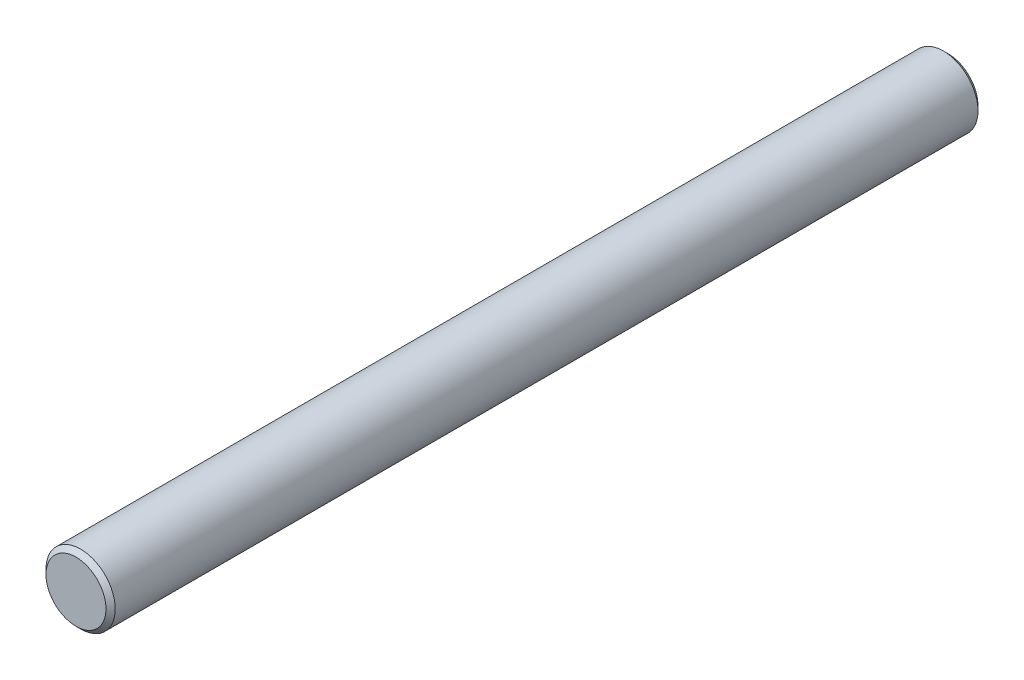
ISO-10303-21;
HEADER;
FILE_DESCRIPTION(('STEP AP214'),'2;1');
FILE_NAME('part.step','',(''),(''),'','','');
FILE_SCHEMA(('AUTOMOTIVE_DESIGN { 1 0 10303 214 1 1 1 1 }'));
ENDSEC;
DATA;
#1=APPLICATION_CONTEXT('core data for automotive mechanical design processes');
#2=APPLICATION_PROTOCOL_DEFINITION('international standard','automotive_design',2000,#1);
#3=PRODUCT_CONTEXT('',#1,'mechanical');
#4=PRODUCT('Part','Part','',(#3));
#5=PRODUCT_RELATED_PRODUCT_CATEGORY('part','',(#4));
#6=PRODUCT_DEFINITION_FORMATION('','',#4);
#7=PRODUCT_DEFINITION_CONTEXT('part definition',#1,'design');
#8=PRODUCT_DEFINITION('design','',#6,#7);
#9=PRODUCT_DEFINITION_SHAPE('','',#8);
#10=(LENGTH_UNIT() NAMED_UNIT(*) SI_UNIT(.MILLI.,.METRE.));
#11=(NAMED_UNIT(*) PLANE_ANGLE_UNIT() SI_UNIT($,.RADIAN.));
#12=(NAMED_UNIT(*) SI_UNIT($,.STERADIAN.) SOLID_ANGLE_UNIT());
#13=UNCERTAINTY_MEASURE_WITH_UNIT(LENGTH_MEASURE(1.E-05),#10,'distance_accuracy_value','');
#14=(GEOMETRIC_REPRESENTATION_CONTEXT(3) GLOBAL_UNCERTAINTY_ASSIGNED_CONTEXT((#13)) GLOBAL_UNIT_ASSIGNED_CONTEXT((#10,
#11,#12)) REPRESENTATION_CONTEXT('',''));
#15=CARTESIAN_POINT('',(0.,0.,0.));
#16=DIRECTION('',(0.,0.,1.));
#17=DIRECTION('',(1.,0.,0.));
#18=AXIS2_PLACEMENT_3D('',#15,#16,#17);
#19=CARTESIAN_POINT('',(0.,0.,37.8));
#20=DIRECTION('',(0.,0.,-1.));
#21=DIRECTION('',(-1.,0.,0.));
#22=AXIS2_PLACEMENT_3D('',#19,#20,#21);
#23=PLANE('',#22);
#24=CARTESIAN_POINT('',(0.,0.,37.8000000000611));
#25=DIRECTION('',(0.,0.,-1.));
#26=DIRECTION('',(-1.,0.,0.));
#27=AXIS2_PLACEMENT_3D('',#24,#25,#26);
#28=CIRCLE('',#27,1.30000000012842);
#29=CARTESIAN_POINT('',(-1.30000000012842,0.,37.8000000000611));
#30=VERTEX_POINT('',#29);
#31=EDGE_CURVE('E17',#30,#30,#28,.T.);
#32=ORIENTED_EDGE('',*,*,#31,.F.);
#33=EDGE_LOOP('',(#32));
#34=FACE_BOUND('',#33,.T.);
#35=ADVANCED_FACE('F13',(#34),#23,.F.);
#36=CARTESIAN_POINT('',(0.,0.,0.));
#37=DIRECTION('',(0.,0.,-1.));
#38=DIRECTION('',(-1.,0.,0.));
#39=AXIS2_PLACEMENT_3D('',#36,#37,#38);
#40=PLANE('',#39);
#41=CARTESIAN_POINT('',(0.,0.,-1.13686837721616E-10));
#42=DIRECTION('',(0.,0.,1.));
#43=DIRECTION('',(0.,-1.,0.));
#44=AXIS2_PLACEMENT_3D('',#41,#42,#43);
#45=CIRCLE('',#44,1.30000000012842);
#46=CARTESIAN_POINT('',(0.,-1.30000000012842,-1.1368684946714E-10));
#47=VERTEX_POINT('',#46);
#48=EDGE_CURVE('E26',#47,#47,#45,.T.);
#49=ORIENTED_EDGE('',*,*,#48,.F.);
#50=EDGE_LOOP('',(#49));
#51=FACE_BOUND('',#50,.T.);
#52=ADVANCED_FACE('F41',(#51),#40,.T.);
#53=CARTESIAN_POINT('',(0.,0.,37.5999999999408));
#54=DIRECTION('',(0.,0.,-1.));
#55=DIRECTION('',(-1.,0.,0.));
#56=AXIS2_PLACEMENT_3D('',#53,#54,#55);
#57=CONICAL_SURFACE('',#56,1.49999999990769,0.785398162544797);
#58=CARTESIAN_POINT('',(0.,0.,37.6));
#59=DIRECTION('',(0.,0.,1.));
#60=DIRECTION('',(1.,0.,0.));
#61=AXIS2_PLACEMENT_3D('',#58,#59,#60);
#62=CIRCLE('',#61,1.5);
#63=CARTESIAN_POINT('',(1.5,0.,37.6));
#64=VERTEX_POINT('',#63);
#65=EDGE_CURVE('E21',#64,#64,#62,.F.);
#66=ORIENTED_EDGE('',*,*,#65,.F.);
#67=EDGE_LOOP('',(#66));
#68=FACE_BOUND('',#67,.T.);
#69=ORIENTED_EDGE('',*,*,#31,.T.);
#70=EDGE_LOOP('',(#69));
#71=FACE_BOUND('',#70,.T.);
#72=ADVANCED_FACE('F38',(#68,#71),#57,.T.);
#73=CARTESIAN_POINT('',(0.,0.,0.200000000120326));
#74=DIRECTION('',(0.,0.,1.));
#75=DIRECTION('',(0.,-1.,0.));
#76=AXIS2_PLACEMENT_3D('',#73,#74,#75);
#77=CONICAL_SURFACE('',#76,1.49999999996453,0.785398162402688);
#78=ORIENTED_EDGE('',*,*,#48,.T.);
#79=EDGE_LOOP('',(#78));
#80=FACE_BOUND('',#79,.T.);
#81=CARTESIAN_POINT('',(0.,0.,0.2));
#82=DIRECTION('',(0.,0.,1.));
#83=DIRECTION('',(1.,0.,0.));
#84=AXIS2_PLACEMENT_3D('',#81,#82,#83);
#85=CIRCLE('',#84,1.5);
#86=CARTESIAN_POINT('',(1.5,0.,0.2));
#87=VERTEX_POINT('',#86);
#88=EDGE_CURVE('E9',#87,#87,#85,.T.);
#89=ORIENTED_EDGE('',*,*,#88,.F.);
#90=EDGE_LOOP('',(#89));
#91=FACE_BOUND('',#90,.T.);
#92=ADVANCED_FACE('F50',(#80,#91),#77,.T.);
#93=CARTESIAN_POINT('',(0.,0.,0.));
#94=DIRECTION('',(0.,0.,1.));
#95=DIRECTION('',(1.,0.,0.));
#96=AXIS2_PLACEMENT_3D('',#93,#94,#95);
#97=CYLINDRICAL_SURFACE('',#96,1.5);
#98=ORIENTED_EDGE('',*,*,#88,.T.);
#99=EDGE_LOOP('',(#98));
#100=FACE_BOUND('',#99,.T.);
#101=ORIENTED_EDGE('',*,*,#65,.T.);
#102=EDGE_LOOP('',(#101));
#103=FACE_BOUND('',#102,.T.);
#104=ADVANCED_FACE('F15',(#100,#103),#97,.T.);
#105=CLOSED_SHELL('',(#35,#52,#72,#92,#104));
#106=MANIFOLD_SOLID_BREP('B1',#105);
#107=ADVANCED_BREP_SHAPE_REPRESENTATION('',(#18,#106),#14);
#108=SHAPE_DEFINITION_REPRESENTATION(#9,#107);
ENDSEC;
END-ISO-10303-21;
